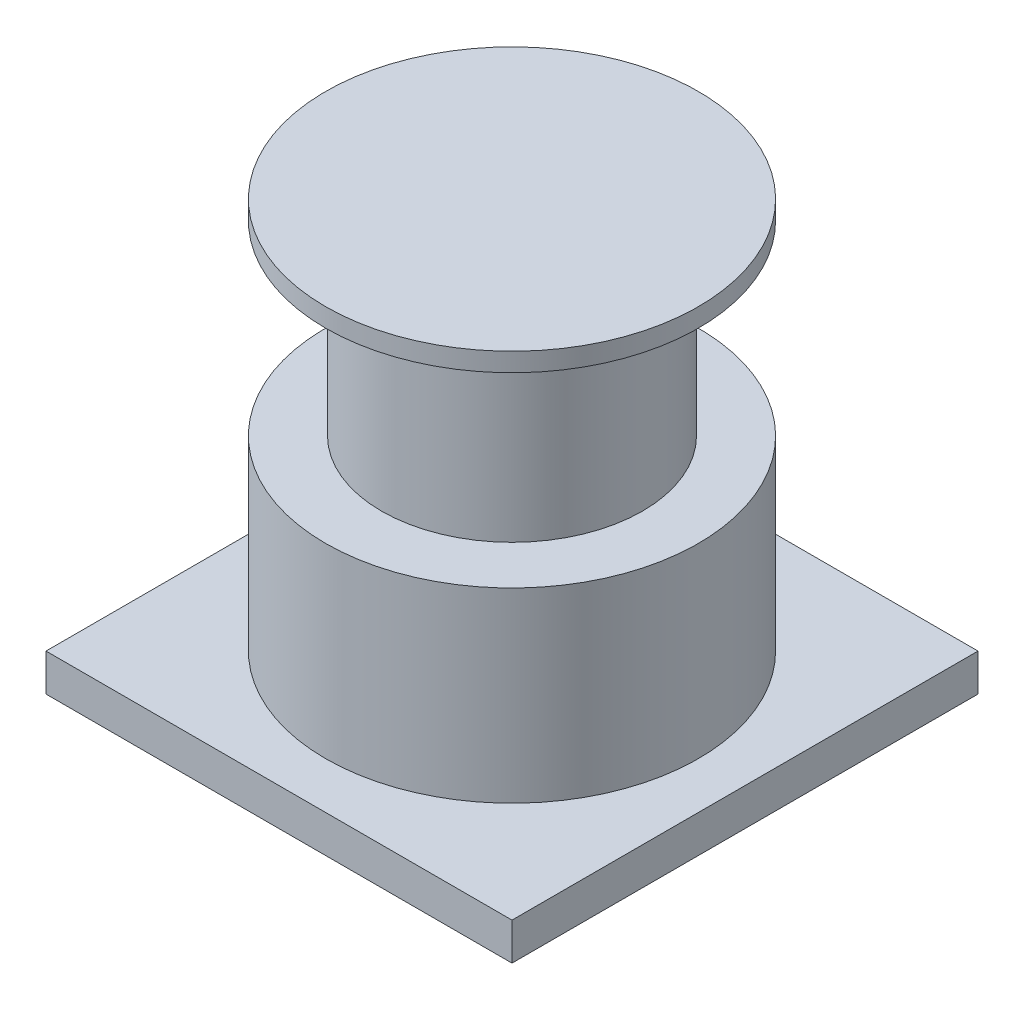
from build123d import *

# Parameters (mm, degrees)
SKETCH1_W           = 250
SKETCH1_H           = 250
BOSS_EXTRUDE1_DEPTH = 20
SKETCH2_R           = 100
BOSS_EXTRUDE2_DEPTH = 100
SKETCH3_R           = 70
BOSS_EXTRUDE3_DEPTH = 100
SKETCH4_R           = 100
BOSS_EXTRUDE4_DEPTH = 10


with BuildPart() as part:
    # Sketch1 → Boss-Extrude1 (new body)
    with BuildSketch(Plane(origin=(0, 0, 0), x_dir=(1, 0, 0), z_dir=(0, 1, 0))):
        with Locations((46.810699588, -38.16872428)):
            Rectangle(SKETCH1_W, SKETCH1_H)
    extrude(amount=BOSS_EXTRUDE1_DEPTH)

    # Sketch2 → Boss-Extrude2 (add)
    with BuildSketch(Plane(origin=(0, 20, 0), x_dir=(1, 0, 0), z_dir=(0, 1, 0))):
        with Locations(Location((46.810699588, -38.16872428, 0), (0, 0, 270))):
            Circle(SKETCH2_R)
    extrude(amount=BOSS_EXTRUDE2_DEPTH)

    # Sketch3 → Boss-Extrude3 (add)
    with BuildSketch(Plane(origin=(0, 120, 0), x_dir=(1, 0, 0), z_dir=(0, 1, 0))):
        with Locations(Location((46.810699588, -38.16872428, 0), (0, 0, 270))):
            Circle(SKETCH3_R)
    extrude(amount=BOSS_EXTRUDE3_DEPTH)

    # Sketch4 → Boss-Extrude4 (add)
    with BuildSketch(Plane(origin=(0, 220, 0), x_dir=(1, 0, 0), z_dir=(0, 1, 0))):
        with Locations(Location((46.810699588, -38.16872428, 0), (0, 0, 270))):
            Circle(SKETCH4_R)
    extrude(amount=BOSS_EXTRUDE4_DEPTH)


solid = part.part
